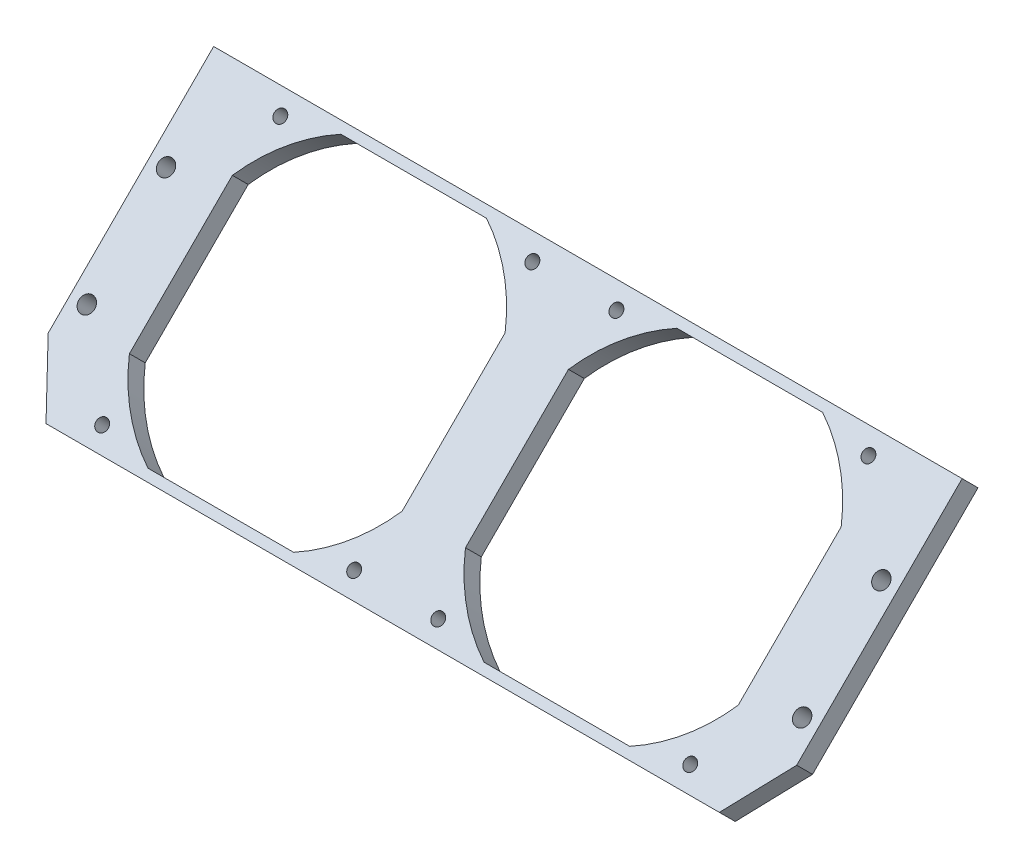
ISO-10303-21;
HEADER;
FILE_DESCRIPTION(('STEP AP214'),'2;1');
FILE_NAME('part.step','',(''),(''),'','','');
FILE_SCHEMA(('AUTOMOTIVE_DESIGN { 1 0 10303 214 1 1 1 1 }'));
ENDSEC;
DATA;
#1=APPLICATION_CONTEXT('core data for automotive mechanical design processes');
#2=APPLICATION_PROTOCOL_DEFINITION('international standard','automotive_design',2000,#1);
#3=PRODUCT_CONTEXT('',#1,'mechanical');
#4=PRODUCT('Part','Part','',(#3));
#5=PRODUCT_RELATED_PRODUCT_CATEGORY('part','',(#4));
#6=PRODUCT_DEFINITION_FORMATION('','',#4);
#7=PRODUCT_DEFINITION_CONTEXT('part definition',#1,'design');
#8=PRODUCT_DEFINITION('design','',#6,#7);
#9=PRODUCT_DEFINITION_SHAPE('','',#8);
#10=(LENGTH_UNIT() NAMED_UNIT(*) SI_UNIT(.MILLI.,.METRE.));
#11=(NAMED_UNIT(*) PLANE_ANGLE_UNIT() SI_UNIT($,.RADIAN.));
#12=(NAMED_UNIT(*) SI_UNIT($,.STERADIAN.) SOLID_ANGLE_UNIT());
#13=UNCERTAINTY_MEASURE_WITH_UNIT(LENGTH_MEASURE(1.E-05),#10,'distance_accuracy_value','');
#14=(GEOMETRIC_REPRESENTATION_CONTEXT(3) GLOBAL_UNCERTAINTY_ASSIGNED_CONTEXT((#13)) GLOBAL_UNIT_ASSIGNED_CONTEXT((#10,
#11,#12)) REPRESENTATION_CONTEXT('',''));
#15=CARTESIAN_POINT('',(0.,0.,0.));
#16=DIRECTION('',(0.,0.,1.));
#17=DIRECTION('',(1.,0.,0.));
#18=AXIS2_PLACEMENT_3D('',#15,#16,#17);
#19=CARTESIAN_POINT('',(-106.0704,62.6556485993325,1.31560752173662));
#20=DIRECTION('',(1.,0.,0.));
#21=DIRECTION('',(0.,0.,-1.));
#22=AXIS2_PLACEMENT_3D('',#19,#20,#21);
#23=PLANE('',#22);
#24=DIRECTION('',(0.,-0.707106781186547,0.707106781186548));
#25=VECTOR('',#24,1.);
#26=CARTESIAN_POINT('',(-106.0704,58.1655205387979,-3.17452053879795));
#27=LINE('',#26,#25);
#28=CARTESIAN_POINT('',(-106.0704,58.1655205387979,-3.17452053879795));
#29=VERTEX_POINT('',#28);
#30=CARTESIAN_POINT('',(-106.0704,11.2675153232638,43.7234846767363));
#31=VERTEX_POINT('',#30);
#32=EDGE_CURVE('E219',#29,#31,#27,.T.);
#33=ORIENTED_EDGE('',*,*,#32,.T.);
#34=DIRECTION('',(0.,0.707106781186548,0.707106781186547));
#35=VECTOR('',#34,1.);
#36=CARTESIAN_POINT('',(-106.0704,-17.8152449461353,14.6407244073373));
#37=LINE('',#36,#35);
#38=CARTESIAN_POINT('',(-106.0704,15.7576433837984,48.2136127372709));
#39=VERTEX_POINT('',#38);
#40=EDGE_CURVE('E64',#31,#39,#37,.T.);
#41=ORIENTED_EDGE('',*,*,#40,.T.);
#42=DIRECTION('',(0.,-0.707106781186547,0.707106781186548));
#43=VECTOR('',#42,1.);
#44=CARTESIAN_POINT('',(-106.0704,62.6556485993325,1.31560752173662));
#45=LINE('',#44,#43);
#46=CARTESIAN_POINT('',(-106.0704,62.6556485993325,1.31560752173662));
#47=VERTEX_POINT('',#46);
#48=EDGE_CURVE('E215',#47,#39,#45,.T.);
#49=ORIENTED_EDGE('',*,*,#48,.F.);
#50=DIRECTION('',(0.,-0.707106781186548,-0.707106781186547));
#51=VECTOR('',#50,1.);
#52=CARTESIAN_POINT('',(-106.0704,62.6556485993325,1.31560752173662));
#53=LINE('',#52,#51);
#54=EDGE_CURVE('E213',#47,#29,#53,.T.);
#55=ORIENTED_EDGE('',*,*,#54,.T.);
#56=EDGE_LOOP('',(#33,#41,#49,#55));
#57=FACE_BOUND('',#56,.T.);
#58=ADVANCED_FACE('F41',(#57),#23,.F.);
#59=CARTESIAN_POINT('',(-106.0704,4.49012806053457,59.4811280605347));
#60=DIRECTION('',(0.,0.707106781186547,-0.707106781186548));
#61=DIRECTION('',(0.,0.707106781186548,0.707106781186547));
#62=AXIS2_PLACEMENT_3D('',#59,#60,#61);
#63=PLANE('',#62);
#64=DIRECTION('',(1.,0.,0.));
#65=VECTOR('',#64,1.);
#66=CARTESIAN_POINT('',(-106.0704,0.,54.9910000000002));
#67=LINE('',#66,#65);
#68=CARTESIAN_POINT('',(-95.4224044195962,0.,54.9910000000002));
#69=VERTEX_POINT('',#68);
#70=CARTESIAN_POINT('',(95.4224044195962,0.,54.9910000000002));
#71=VERTEX_POINT('',#70);
#72=EDGE_CURVE('E222',#69,#71,#67,.T.);
#73=ORIENTED_EDGE('',*,*,#72,.T.);
#74=DIRECTION('',(0.,0.707106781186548,0.707106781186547));
#75=VECTOR('',#74,1.);
#76=CARTESIAN_POINT('',(95.4224044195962,-29.0827602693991,25.9082397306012));
#77=LINE('',#76,#75);
#78=CARTESIAN_POINT('',(95.4224044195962,4.49012806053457,59.4811280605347));
#79=VERTEX_POINT('',#78);
#80=EDGE_CURVE('E57',#71,#79,#77,.T.);
#81=ORIENTED_EDGE('',*,*,#80,.T.);
#82=DIRECTION('',(1.,0.,0.));
#83=VECTOR('',#82,1.);
#84=CARTESIAN_POINT('',(-106.0704,4.49012806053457,59.4811280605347));
#85=LINE('',#84,#83);
#86=CARTESIAN_POINT('',(-95.4224044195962,4.49012806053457,59.4811280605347));
#87=VERTEX_POINT('',#86);
#88=EDGE_CURVE('E204',#87,#79,#85,.T.);
#89=ORIENTED_EDGE('',*,*,#88,.F.);
#90=DIRECTION('',(0.,0.707106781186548,0.707106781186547));
#91=VECTOR('',#90,1.);
#92=CARTESIAN_POINT('',(-95.4224044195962,-29.0827602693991,25.9082397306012));
#93=LINE('',#92,#91);
#94=EDGE_CURVE('E205',#69,#87,#93,.T.);
#95=ORIENTED_EDGE('',*,*,#94,.F.);
#96=EDGE_LOOP('',(#73,#81,#89,#95));
#97=FACE_BOUND('',#96,.T.);
#98=ADVANCED_FACE('F449',(#97),#63,.F.);
#99=CARTESIAN_POINT('',(106.0704,62.6556485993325,1.31560752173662));
#100=DIRECTION('',(-1.,0.,0.));
#101=DIRECTION('',(0.,0.,1.));
#102=AXIS2_PLACEMENT_3D('',#99,#100,#101);
#103=PLANE('',#102);
#104=DIRECTION('',(0.,0.707106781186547,-0.707106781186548));
#105=VECTOR('',#104,1.);
#106=CARTESIAN_POINT('',(106.0704,62.6556485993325,1.31560752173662));
#107=LINE('',#106,#105);
#108=CARTESIAN_POINT('',(106.0704,15.7576433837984,48.2136127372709));
#109=VERTEX_POINT('',#108);
#110=CARTESIAN_POINT('',(106.0704,62.6556485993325,1.31560752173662));
#111=VERTEX_POINT('',#110);
#112=EDGE_CURVE('E200',#109,#111,#107,.T.);
#113=ORIENTED_EDGE('',*,*,#112,.F.);
#114=DIRECTION('',(0.,0.707106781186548,0.707106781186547));
#115=VECTOR('',#114,1.);
#116=CARTESIAN_POINT('',(106.0704,-17.8152449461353,14.6407244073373));
#117=LINE('',#116,#115);
#118=CARTESIAN_POINT('',(106.0704,11.2675153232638,43.7234846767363));
#119=VERTEX_POINT('',#118);
#120=EDGE_CURVE('E188',#119,#109,#117,.T.);
#121=ORIENTED_EDGE('',*,*,#120,.F.);
#122=DIRECTION('',(0.,0.707106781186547,-0.707106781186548));
#123=VECTOR('',#122,1.);
#124=CARTESIAN_POINT('',(106.0704,58.1655205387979,-3.17452053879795));
#125=LINE('',#124,#123);
#126=CARTESIAN_POINT('',(106.0704,58.1655205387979,-3.17452053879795));
#127=VERTEX_POINT('',#126);
#128=EDGE_CURVE('E226',#119,#127,#125,.T.);
#129=ORIENTED_EDGE('',*,*,#128,.T.);
#130=DIRECTION('',(0.,-0.707106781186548,-0.707106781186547));
#131=VECTOR('',#130,1.);
#132=CARTESIAN_POINT('',(106.0704,62.6556485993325,1.31560752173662));
#133=LINE('',#132,#131);
#134=EDGE_CURVE('E209',#111,#127,#133,.T.);
#135=ORIENTED_EDGE('',*,*,#134,.F.);
#136=EDGE_LOOP('',(#113,#121,#129,#135));
#137=FACE_BOUND('',#136,.T.);
#138=ADVANCED_FACE('F207',(#137),#103,.F.);
#139=CARTESIAN_POINT('',(-106.0704,62.6556485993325,1.31560752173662));
#140=DIRECTION('',(0.,-0.707106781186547,0.707106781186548));
#141=DIRECTION('',(0.,-0.707106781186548,-0.707106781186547));
#142=AXIS2_PLACEMENT_3D('',#139,#140,#141);
#143=PLANE('',#142);
#144=DIRECTION('',(-1.,0.,0.));
#145=VECTOR('',#144,1.);
#146=CARTESIAN_POINT('',(-106.0704,58.1655205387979,-3.17452053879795));
#147=LINE('',#146,#145);
#148=EDGE_CURVE('E228',#127,#29,#147,.T.);
#149=ORIENTED_EDGE('',*,*,#148,.T.);
#150=ORIENTED_EDGE('',*,*,#54,.F.);
#151=DIRECTION('',(-1.,0.,0.));
#152=VECTOR('',#151,1.);
#153=CARTESIAN_POINT('',(-106.0704,62.6556485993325,1.31560752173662));
#154=LINE('',#153,#152);
#155=EDGE_CURVE('E211',#111,#47,#154,.T.);
#156=ORIENTED_EDGE('',*,*,#155,.F.);
#157=ORIENTED_EDGE('',*,*,#134,.T.);
#158=EDGE_LOOP('',(#149,#150,#156,#157));
#159=FACE_BOUND('',#158,.T.);
#160=ADVANCED_FACE('F455',(#159),#143,.F.);
#161=CARTESIAN_POINT('',(0.,31.9856280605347,31.9856280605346));
#162=DIRECTION('',(0.,0.707106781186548,0.707106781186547));
#163=DIRECTION('',(0.,-0.707106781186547,0.707106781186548));
#164=AXIS2_PLACEMENT_3D('',#161,#162,#163);
#165=PLANE('',#164);
#166=CARTESIAN_POINT('',(101.3714,22.0056478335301,41.9656082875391));
#167=DIRECTION('',(0.,0.707106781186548,0.707106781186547));
#168=DIRECTION('',(0.,-0.707106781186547,0.707106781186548));
#169=AXIS2_PLACEMENT_3D('',#166,#167,#168);
#170=CIRCLE('',#169,2.2479);
#171=CARTESIAN_POINT('',(101.3714,20.4161425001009,43.5551136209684));
#172=VERTEX_POINT('',#171);
#173=EDGE_CURVE('E285',#172,#172,#170,.T.);
#174=ORIENTED_EDGE('',*,*,#173,.F.);
#175=EDGE_LOOP('',(#174));
#176=FACE_BOUND('',#175,.T.);
#177=CARTESIAN_POINT('',(101.3714,44.456288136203,19.5149679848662));
#178=DIRECTION('',(0.,0.707106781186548,0.707106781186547));
#179=DIRECTION('',(0.,-0.707106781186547,0.707106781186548));
#180=AXIS2_PLACEMENT_3D('',#177,#178,#179);
#181=CIRCLE('',#180,2.2479);
#182=CARTESIAN_POINT('',(101.3714,42.8667828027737,21.1044733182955));
#183=VERTEX_POINT('',#182);
#184=EDGE_CURVE('E274',#183,#183,#181,.T.);
#185=ORIENTED_EDGE('',*,*,#184,.F.);
#186=EDGE_LOOP('',(#185));
#187=FACE_BOUND('',#186,.T.);
#188=CARTESIAN_POINT('',(-101.3714,44.456288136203,19.5149679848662));
#189=DIRECTION('',(0.,0.707106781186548,0.707106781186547));
#190=DIRECTION('',(0.,-0.707106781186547,0.707106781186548));
#191=AXIS2_PLACEMENT_3D('',#188,#189,#190);
#192=CIRCLE('',#191,2.2479);
#193=CARTESIAN_POINT('',(-101.3714,42.8667828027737,21.1044733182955));
#194=VERTEX_POINT('',#193);
#195=EDGE_CURVE('E273',#194,#194,#192,.T.);
#196=ORIENTED_EDGE('',*,*,#195,.F.);
#197=EDGE_LOOP('',(#196));
#198=FACE_BOUND('',#197,.T.);
#199=CARTESIAN_POINT('',(-101.3714,22.0056478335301,41.9656082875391));
#200=DIRECTION('',(0.,0.707106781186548,0.707106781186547));
#201=DIRECTION('',(0.,-0.707106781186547,0.707106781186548));
#202=AXIS2_PLACEMENT_3D('',#199,#200,#201);
#203=CIRCLE('',#202,2.2479);
#204=CARTESIAN_POINT('',(-101.3714,20.4161425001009,43.5551136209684));
#205=VERTEX_POINT('',#204);
#206=EDGE_CURVE('E270',#205,#205,#203,.T.);
#207=ORIENTED_EDGE('',*,*,#206,.F.);
#208=EDGE_LOOP('',(#207));
#209=FACE_BOUND('',#208,.T.);
#210=DIRECTION('',(-0.555598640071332,-0.587924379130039,0.587924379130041));
#211=VECTOR('',#210,1.);
#212=CARTESIAN_POINT('',(106.0704,15.7576433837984,48.2136127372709));
#213=LINE('',#212,#211);
#214=EDGE_CURVE('E191',#109,#79,#213,.T.);
#215=ORIENTED_EDGE('',*,*,#214,.F.);
#216=ORIENTED_EDGE('',*,*,#112,.T.);
#217=ORIENTED_EDGE('',*,*,#155,.T.);
#218=ORIENTED_EDGE('',*,*,#48,.T.);
#219=DIRECTION('',(-0.555598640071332,0.587924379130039,-0.587924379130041));
#220=VECTOR('',#219,1.);
#221=CARTESIAN_POINT('',(-106.0704,15.7576433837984,48.2136127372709));
#222=LINE('',#221,#220);
#223=EDGE_CURVE('E269',#87,#39,#222,.T.);
#224=ORIENTED_EDGE('',*,*,#223,.F.);
#225=ORIENTED_EDGE('',*,*,#88,.T.);
#226=EDGE_LOOP('',(#215,#216,#217,#218,#224,#225));
#227=FACE_BOUND('',#226,.T.);
#228=CARTESIAN_POINT('',(11.9126,58.82536854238,5.14588757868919));
#229=DIRECTION('',(0.,0.707106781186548,0.707106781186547));
#230=DIRECTION('',(0.,-0.707106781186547,0.707106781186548));
#231=AXIS2_PLACEMENT_3D('',#228,#229,#230);
#232=CIRCLE('',#231,1.72719999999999);
#233=CARTESIAN_POINT('',(11.9126,57.6040537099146,6.36720241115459));
#234=VERTEX_POINT('',#233);
#235=EDGE_CURVE('E265',#234,#234,#232,.T.);
#236=ORIENTED_EDGE('',*,*,#235,.F.);
#237=EDGE_LOOP('',(#236));
#238=FACE_BOUND('',#237,.T.);
#239=CARTESIAN_POINT('',(83.3374,58.82536854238,5.14588757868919));
#240=DIRECTION('',(0.,0.707106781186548,0.707106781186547));
#241=DIRECTION('',(0.,-0.707106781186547,0.707106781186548));
#242=AXIS2_PLACEMENT_3D('',#239,#240,#241);
#243=CIRCLE('',#242,1.7272);
#244=CARTESIAN_POINT('',(83.3374,57.6040537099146,6.36720241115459));
#245=VERTEX_POINT('',#244);
#246=EDGE_CURVE('E261',#245,#245,#243,.T.);
#247=ORIENTED_EDGE('',*,*,#246,.F.);
#248=EDGE_LOOP('',(#247));
#249=FACE_BOUND('',#248,.T.);
#250=CARTESIAN_POINT('',(83.3374,8.32040811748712,55.6508480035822));
#251=DIRECTION('',(0.,0.707106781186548,0.707106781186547));
#252=DIRECTION('',(0.,-0.707106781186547,0.707106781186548));
#253=AXIS2_PLACEMENT_3D('',#250,#251,#252);
#254=CIRCLE('',#253,1.7272);
#255=CARTESIAN_POINT('',(83.3374,7.09909328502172,56.8721628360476));
#256=VERTEX_POINT('',#255);
#257=EDGE_CURVE('E257',#256,#256,#254,.T.);
#258=ORIENTED_EDGE('',*,*,#257,.F.);
#259=EDGE_LOOP('',(#258));
#260=FACE_BOUND('',#259,.T.);
#261=CARTESIAN_POINT('',(11.9126,8.32040811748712,55.6508480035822));
#262=DIRECTION('',(0.,0.707106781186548,0.707106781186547));
#263=DIRECTION('',(0.,-0.707106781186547,0.707106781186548));
#264=AXIS2_PLACEMENT_3D('',#261,#262,#263);
#265=CIRCLE('',#264,1.72719999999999);
#266=CARTESIAN_POINT('',(11.9126,7.09909328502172,56.8721628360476));
#267=VERTEX_POINT('',#266);
#268=EDGE_CURVE('E253',#267,#267,#265,.T.);
#269=ORIENTED_EDGE('',*,*,#268,.F.);
#270=EDGE_LOOP('',(#269));
#271=FACE_BOUND('',#270,.T.);
#272=CARTESIAN_POINT('',(-11.9126,8.32040811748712,55.6508480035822));
#273=DIRECTION('',(0.,0.707106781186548,0.707106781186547));
#274=DIRECTION('',(0.,-0.707106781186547,0.707106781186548));
#275=AXIS2_PLACEMENT_3D('',#272,#273,#274);
#276=CIRCLE('',#275,1.72719999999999);
#277=CARTESIAN_POINT('',(-11.9126,7.09909328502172,56.8721628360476));
#278=VERTEX_POINT('',#277);
#279=EDGE_CURVE('E249',#278,#278,#276,.T.);
#280=ORIENTED_EDGE('',*,*,#279,.F.);
#281=EDGE_LOOP('',(#280));
#282=FACE_BOUND('',#281,.T.);
#283=CARTESIAN_POINT('',(-83.3374,8.32040811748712,55.6508480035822));
#284=DIRECTION('',(0.,0.707106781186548,0.707106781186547));
#285=DIRECTION('',(0.,-0.707106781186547,0.707106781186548));
#286=AXIS2_PLACEMENT_3D('',#283,#284,#285);
#287=CIRCLE('',#286,1.7272);
#288=CARTESIAN_POINT('',(-83.3374,7.09909328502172,56.8721628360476));
#289=VERTEX_POINT('',#288);
#290=EDGE_CURVE('E245',#289,#289,#287,.T.);
#291=ORIENTED_EDGE('',*,*,#290,.F.);
#292=EDGE_LOOP('',(#291));
#293=FACE_BOUND('',#292,.T.);
#294=CARTESIAN_POINT('',(-83.3374,58.82536854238,5.14588757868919));
#295=DIRECTION('',(0.,0.707106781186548,0.707106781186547));
#296=DIRECTION('',(0.,-0.707106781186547,0.707106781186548));
#297=AXIS2_PLACEMENT_3D('',#294,#295,#296);
#298=CIRCLE('',#297,1.7272);
#299=CARTESIAN_POINT('',(-83.3374,57.6040537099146,6.36720241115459));
#300=VERTEX_POINT('',#299);
#301=EDGE_CURVE('E241',#300,#300,#298,.T.);
#302=ORIENTED_EDGE('',*,*,#301,.F.);
#303=EDGE_LOOP('',(#302));
#304=FACE_BOUND('',#303,.T.);
#305=CARTESIAN_POINT('',(-11.9126,58.82536854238,5.14588757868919));
#306=DIRECTION('',(0.,0.707106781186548,0.707106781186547));
#307=DIRECTION('',(0.,-0.707106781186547,0.707106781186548));
#308=AXIS2_PLACEMENT_3D('',#305,#306,#307);
#309=CIRCLE('',#308,1.72719999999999);
#310=CARTESIAN_POINT('',(-11.9126,57.6040537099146,6.36720241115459));
#311=VERTEX_POINT('',#310);
#312=EDGE_CURVE('E237',#311,#311,#309,.T.);
#313=ORIENTED_EDGE('',*,*,#312,.F.);
#314=EDGE_LOOP('',(#313));
#315=FACE_BOUND('',#314,.T.);
#316=CARTESIAN_POINT('',(47.625,33.5728883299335,30.3983677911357));
#317=DIRECTION('',(0.,0.707106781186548,0.707106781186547));
#318=DIRECTION('',(0.,-0.707106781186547,0.707106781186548));
#319=AXIS2_PLACEMENT_3D('',#316,#317,#318);
#320=CIRCLE('',#319,43.815);
#321=CARTESIAN_POINT('',(68.2625,6.24297963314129,57.728276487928));
#322=VERTEX_POINT('',#321);
#323=CARTESIAN_POINT('',(86.275327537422,18.9799721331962,44.9912839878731));
#324=VERTEX_POINT('',#323);
#325=EDGE_CURVE('E338',#322,#324,#320,.T.);
#326=ORIENTED_EDGE('',*,*,#325,.F.);
#327=DIRECTION('',(1.,0.,0.));
#328=VECTOR('',#327,1.);
#329=CARTESIAN_POINT('',(26.9875,6.24297963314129,57.728276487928));
#330=LINE('',#329,#328);
#331=CARTESIAN_POINT('',(26.9875,6.24297963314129,57.728276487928));
#332=VERTEX_POINT('',#331);
#333=EDGE_CURVE('E316',#332,#322,#330,.T.);
#334=ORIENTED_EDGE('',*,*,#333,.F.);
#335=CARTESIAN_POINT('',(47.625,33.5728883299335,30.3983677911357));
#336=DIRECTION('',(0.,0.707106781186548,0.707106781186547));
#337=DIRECTION('',(0.,-0.707106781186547,0.707106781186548));
#338=AXIS2_PLACEMENT_3D('',#335,#336,#337);
#339=CIRCLE('',#338,43.815);
#340=CARTESIAN_POINT('',(8.974672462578,18.9799721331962,44.9912839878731));
#341=VERTEX_POINT('',#340);
#342=EDGE_CURVE('E356',#341,#332,#339,.T.);
#343=ORIENTED_EDGE('',*,*,#342,.F.);
#344=DIRECTION('',(0.,-0.707106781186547,0.707106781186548));
#345=VECTOR('',#344,1.);
#346=CARTESIAN_POINT('',(8.97467246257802,48.1658045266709,15.8054515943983));
#347=LINE('',#346,#345);
#348=CARTESIAN_POINT('',(8.97467246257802,48.1658045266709,15.8054515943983));
#349=VERTEX_POINT('',#348);
#350=EDGE_CURVE('E353',#349,#341,#347,.T.);
#351=ORIENTED_EDGE('',*,*,#350,.F.);
#352=CARTESIAN_POINT('',(47.625,33.5728883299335,30.3983677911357));
#353=DIRECTION('',(0.,0.707106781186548,0.707106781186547));
#354=DIRECTION('',(0.,-0.707106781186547,0.707106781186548));
#355=AXIS2_PLACEMENT_3D('',#352,#353,#354);
#356=CIRCLE('',#355,43.815);
#357=CARTESIAN_POINT('',(26.9875,60.9027970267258,3.06845909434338));
#358=VERTEX_POINT('',#357);
#359=EDGE_CURVE('E350',#358,#349,#356,.T.);
#360=ORIENTED_EDGE('',*,*,#359,.F.);
#361=DIRECTION('',(-1.,0.,0.));
#362=VECTOR('',#361,1.);
#363=CARTESIAN_POINT('',(26.9875,60.9027970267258,3.06845909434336));
#364=LINE('',#363,#362);
#365=CARTESIAN_POINT('',(68.2625,60.9027970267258,3.06845909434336));
#366=VERTEX_POINT('',#365);
#367=EDGE_CURVE('E347',#366,#358,#364,.T.);
#368=ORIENTED_EDGE('',*,*,#367,.F.);
#369=CARTESIAN_POINT('',(47.625,33.5728883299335,30.3983677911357));
#370=DIRECTION('',(0.,0.707106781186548,0.707106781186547));
#371=DIRECTION('',(0.,-0.707106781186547,0.707106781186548));
#372=AXIS2_PLACEMENT_3D('',#369,#370,#371);
#373=CIRCLE('',#372,43.815);
#374=CARTESIAN_POINT('',(86.275327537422,48.1658045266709,15.8054515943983));
#375=VERTEX_POINT('',#374);
#376=EDGE_CURVE('E344',#375,#366,#373,.T.);
#377=ORIENTED_EDGE('',*,*,#376,.F.);
#378=DIRECTION('',(0.,0.707106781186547,-0.707106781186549));
#379=VECTOR('',#378,1.);
#380=CARTESIAN_POINT('',(86.275327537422,48.1658045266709,15.8054515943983));
#381=LINE('',#380,#379);
#382=EDGE_CURVE('E340',#324,#375,#381,.T.);
#383=ORIENTED_EDGE('',*,*,#382,.F.);
#384=EDGE_LOOP('',(#326,#334,#343,#351,#360,#368,#377,#383));
#385=FACE_BOUND('',#384,.T.);
#386=CARTESIAN_POINT('',(-47.625,33.5728883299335,30.3983677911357));
#387=DIRECTION('',(0.,0.707106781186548,0.707106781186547));
#388=DIRECTION('',(0.,0.707106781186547,-0.707106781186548));
#389=AXIS2_PLACEMENT_3D('',#386,#387,#388);
#390=CIRCLE('',#389,43.815);
#391=CARTESIAN_POINT('',(-68.2625,60.9027970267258,3.06845909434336));
#392=VERTEX_POINT('',#391);
#393=CARTESIAN_POINT('',(-86.275327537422,48.1658045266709,15.8054515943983));
#394=VERTEX_POINT('',#393);
#395=EDGE_CURVE('E236',#392,#394,#390,.T.);
#396=ORIENTED_EDGE('',*,*,#395,.F.);
#397=DIRECTION('',(-1.,0.,0.));
#398=VECTOR('',#397,1.);
#399=CARTESIAN_POINT('',(-26.9875,60.9027970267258,3.06845909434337));
#400=LINE('',#399,#398);
#401=CARTESIAN_POINT('',(-26.9875,60.9027970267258,3.06845909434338));
#402=VERTEX_POINT('',#401);
#403=EDGE_CURVE('E380',#402,#392,#400,.T.);
#404=ORIENTED_EDGE('',*,*,#403,.F.);
#405=CARTESIAN_POINT('',(-47.625,33.5728883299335,30.3983677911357));
#406=DIRECTION('',(0.,0.707106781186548,0.707106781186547));
#407=DIRECTION('',(0.,0.707106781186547,-0.707106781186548));
#408=AXIS2_PLACEMENT_3D('',#405,#406,#407);
#409=CIRCLE('',#408,43.815);
#410=CARTESIAN_POINT('',(-8.97467246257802,48.1658045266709,15.8054515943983));
#411=VERTEX_POINT('',#410);
#412=EDGE_CURVE('E418',#411,#402,#409,.T.);
#413=ORIENTED_EDGE('',*,*,#412,.F.);
#414=DIRECTION('',(0.,0.707106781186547,-0.707106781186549));
#415=VECTOR('',#414,1.);
#416=CARTESIAN_POINT('',(-8.97467246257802,48.1658045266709,15.8054515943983));
#417=LINE('',#416,#415);
#418=CARTESIAN_POINT('',(-8.974672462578,18.9799721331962,44.9912839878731));
#419=VERTEX_POINT('',#418);
#420=EDGE_CURVE('E415',#419,#411,#417,.T.);
#421=ORIENTED_EDGE('',*,*,#420,.F.);
#422=CARTESIAN_POINT('',(-47.625,33.5728883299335,30.3983677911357));
#423=DIRECTION('',(0.,0.707106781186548,0.707106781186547));
#424=DIRECTION('',(0.,0.707106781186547,-0.707106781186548));
#425=AXIS2_PLACEMENT_3D('',#422,#423,#424);
#426=CIRCLE('',#425,43.815);
#427=CARTESIAN_POINT('',(-26.9875,6.24297963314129,57.728276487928));
#428=VERTEX_POINT('',#427);
#429=EDGE_CURVE('E412',#428,#419,#426,.T.);
#430=ORIENTED_EDGE('',*,*,#429,.F.);
#431=DIRECTION('',(1.,0.,0.));
#432=VECTOR('',#431,1.);
#433=CARTESIAN_POINT('',(-26.9875,6.24297963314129,57.728276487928));
#434=LINE('',#433,#432);
#435=CARTESIAN_POINT('',(-68.2625,6.2429796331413,57.728276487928));
#436=VERTEX_POINT('',#435);
#437=EDGE_CURVE('E409',#436,#428,#434,.T.);
#438=ORIENTED_EDGE('',*,*,#437,.F.);
#439=CARTESIAN_POINT('',(-47.625,33.5728883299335,30.3983677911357));
#440=DIRECTION('',(0.,0.707106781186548,0.707106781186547));
#441=DIRECTION('',(0.,0.707106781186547,-0.707106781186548));
#442=AXIS2_PLACEMENT_3D('',#439,#440,#441);
#443=CIRCLE('',#442,43.815);
#444=CARTESIAN_POINT('',(-86.275327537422,18.9799721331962,44.9912839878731));
#445=VERTEX_POINT('',#444);
#446=EDGE_CURVE('E406',#445,#436,#443,.T.);
#447=ORIENTED_EDGE('',*,*,#446,.F.);
#448=DIRECTION('',(0.,-0.707106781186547,0.707106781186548));
#449=VECTOR('',#448,1.);
#450=CARTESIAN_POINT('',(-86.275327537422,48.1658045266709,15.8054515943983));
#451=LINE('',#450,#449);
#452=EDGE_CURVE('E403',#394,#445,#451,.T.);
#453=ORIENTED_EDGE('',*,*,#452,.F.);
#454=EDGE_LOOP('',(#396,#404,#413,#421,#430,#438,#447,#453));
#455=FACE_BOUND('',#454,.T.);
#456=ADVANCED_FACE('F198',(#176,#187,#198,#209,#227,#238,#249,#260,#271,#282,#293,#304,#315,
#385,#455),#165,.T.);
#457=CARTESIAN_POINT('',(0.,27.4955000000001,27.4955));
#458=DIRECTION('',(0.,0.707106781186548,0.707106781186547));
#459=DIRECTION('',(0.,-0.707106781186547,0.707106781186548));
#460=AXIS2_PLACEMENT_3D('',#457,#458,#459);
#461=PLANE('',#460);
#462=CARTESIAN_POINT('',(101.3714,17.5155197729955,37.4754802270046));
#463=DIRECTION('',(0.,0.707106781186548,0.707106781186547));
#464=DIRECTION('',(0.,-0.707106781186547,0.707106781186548));
#465=AXIS2_PLACEMENT_3D('',#462,#463,#464);
#466=CIRCLE('',#465,2.2479);
#467=CARTESIAN_POINT('',(101.3714,15.9260144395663,39.0649855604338));
#468=VERTEX_POINT('',#467);
#469=EDGE_CURVE('E44',#468,#468,#466,.T.);
#470=ORIENTED_EDGE('',*,*,#469,.T.);
#471=EDGE_LOOP('',(#470));
#472=FACE_BOUND('',#471,.T.);
#473=CARTESIAN_POINT('',(101.3714,39.9661600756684,15.0248399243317));
#474=DIRECTION('',(0.,0.707106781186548,0.707106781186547));
#475=DIRECTION('',(0.,-0.707106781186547,0.707106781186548));
#476=AXIS2_PLACEMENT_3D('',#473,#474,#475);
#477=CIRCLE('',#476,2.2479);
#478=CARTESIAN_POINT('',(101.3714,38.3766547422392,16.6143452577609));
#479=VERTEX_POINT('',#478);
#480=EDGE_CURVE('E271',#479,#479,#477,.T.);
#481=ORIENTED_EDGE('',*,*,#480,.T.);
#482=EDGE_LOOP('',(#481));
#483=FACE_BOUND('',#482,.T.);
#484=CARTESIAN_POINT('',(-101.3714,39.9661600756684,15.0248399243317));
#485=DIRECTION('',(0.,0.707106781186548,0.707106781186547));
#486=DIRECTION('',(0.,-0.707106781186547,0.707106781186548));
#487=AXIS2_PLACEMENT_3D('',#484,#485,#486);
#488=CIRCLE('',#487,2.2479);
#489=CARTESIAN_POINT('',(-101.3714,38.3766547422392,16.6143452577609));
#490=VERTEX_POINT('',#489);
#491=EDGE_CURVE('E278',#490,#490,#488,.T.);
#492=ORIENTED_EDGE('',*,*,#491,.T.);
#493=EDGE_LOOP('',(#492));
#494=FACE_BOUND('',#493,.T.);
#495=CARTESIAN_POINT('',(-101.3714,17.5155197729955,37.4754802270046));
#496=DIRECTION('',(0.,0.707106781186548,0.707106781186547));
#497=DIRECTION('',(0.,-0.707106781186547,0.707106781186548));
#498=AXIS2_PLACEMENT_3D('',#495,#496,#497);
#499=CIRCLE('',#498,2.2479);
#500=CARTESIAN_POINT('',(-101.3714,15.9260144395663,39.0649855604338));
#501=VERTEX_POINT('',#500);
#502=EDGE_CURVE('E267',#501,#501,#499,.T.);
#503=ORIENTED_EDGE('',*,*,#502,.T.);
#504=EDGE_LOOP('',(#503));
#505=FACE_BOUND('',#504,.T.);
#506=CARTESIAN_POINT('',(11.9126,54.3352404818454,0.65575951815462));
#507=DIRECTION('',(0.,0.707106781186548,0.707106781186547));
#508=DIRECTION('',(0.,-0.707106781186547,0.707106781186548));
#509=AXIS2_PLACEMENT_3D('',#506,#507,#508);
#510=CIRCLE('',#509,1.72719999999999);
#511=CARTESIAN_POINT('',(11.9126,53.11392564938,1.87707435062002));
#512=VERTEX_POINT('',#511);
#513=EDGE_CURVE('E262',#512,#512,#510,.T.);
#514=ORIENTED_EDGE('',*,*,#513,.T.);
#515=EDGE_LOOP('',(#514));
#516=FACE_BOUND('',#515,.T.);
#517=CARTESIAN_POINT('',(83.3374,54.3352404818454,0.65575951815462));
#518=DIRECTION('',(0.,0.707106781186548,0.707106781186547));
#519=DIRECTION('',(0.,-0.707106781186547,0.707106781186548));
#520=AXIS2_PLACEMENT_3D('',#517,#518,#519);
#521=CIRCLE('',#520,1.72719999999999);
#522=CARTESIAN_POINT('',(83.3374,53.11392564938,1.87707435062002));
#523=VERTEX_POINT('',#522);
#524=EDGE_CURVE('E258',#523,#523,#521,.T.);
#525=ORIENTED_EDGE('',*,*,#524,.T.);
#526=EDGE_LOOP('',(#525));
#527=FACE_BOUND('',#526,.T.);
#528=CARTESIAN_POINT('',(83.3374,3.83028005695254,51.1607199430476));
#529=DIRECTION('',(0.,0.707106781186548,0.707106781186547));
#530=DIRECTION('',(0.,-0.707106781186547,0.707106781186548));
#531=AXIS2_PLACEMENT_3D('',#528,#529,#530);
#532=CIRCLE('',#531,1.72719999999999);
#533=CARTESIAN_POINT('',(83.3374,2.60896522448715,52.382034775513));
#534=VERTEX_POINT('',#533);
#535=EDGE_CURVE('E254',#534,#534,#532,.T.);
#536=ORIENTED_EDGE('',*,*,#535,.T.);
#537=EDGE_LOOP('',(#536));
#538=FACE_BOUND('',#537,.T.);
#539=CARTESIAN_POINT('',(11.9126,3.83028005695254,51.1607199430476));
#540=DIRECTION('',(0.,0.707106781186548,0.707106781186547));
#541=DIRECTION('',(0.,-0.707106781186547,0.707106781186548));
#542=AXIS2_PLACEMENT_3D('',#539,#540,#541);
#543=CIRCLE('',#542,1.72719999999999);
#544=CARTESIAN_POINT('',(11.9126,2.60896522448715,52.382034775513));
#545=VERTEX_POINT('',#544);
#546=EDGE_CURVE('E250',#545,#545,#543,.T.);
#547=ORIENTED_EDGE('',*,*,#546,.T.);
#548=EDGE_LOOP('',(#547));
#549=FACE_BOUND('',#548,.T.);
#550=CARTESIAN_POINT('',(-11.9126,3.83028005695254,51.1607199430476));
#551=DIRECTION('',(0.,0.707106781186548,0.707106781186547));
#552=DIRECTION('',(0.,-0.707106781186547,0.707106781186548));
#553=AXIS2_PLACEMENT_3D('',#550,#551,#552);
#554=CIRCLE('',#553,1.72719999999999);
#555=CARTESIAN_POINT('',(-11.9126,2.60896522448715,52.382034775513));
#556=VERTEX_POINT('',#555);
#557=EDGE_CURVE('E246',#556,#556,#554,.T.);
#558=ORIENTED_EDGE('',*,*,#557,.T.);
#559=EDGE_LOOP('',(#558));
#560=FACE_BOUND('',#559,.T.);
#561=CARTESIAN_POINT('',(-83.3374,3.83028005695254,51.1607199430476));
#562=DIRECTION('',(0.,0.707106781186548,0.707106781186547));
#563=DIRECTION('',(0.,-0.707106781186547,0.707106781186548));
#564=AXIS2_PLACEMENT_3D('',#561,#562,#563);
#565=CIRCLE('',#564,1.72719999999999);
#566=CARTESIAN_POINT('',(-83.3374,2.60896522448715,52.382034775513));
#567=VERTEX_POINT('',#566);
#568=EDGE_CURVE('E242',#567,#567,#565,.T.);
#569=ORIENTED_EDGE('',*,*,#568,.T.);
#570=EDGE_LOOP('',(#569));
#571=FACE_BOUND('',#570,.T.);
#572=CARTESIAN_POINT('',(-83.3374,54.3352404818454,0.65575951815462));
#573=DIRECTION('',(0.,0.707106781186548,0.707106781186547));
#574=DIRECTION('',(0.,-0.707106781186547,0.707106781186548));
#575=AXIS2_PLACEMENT_3D('',#572,#573,#574);
#576=CIRCLE('',#575,1.72719999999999);
#577=CARTESIAN_POINT('',(-83.3374,53.11392564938,1.87707435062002));
#578=VERTEX_POINT('',#577);
#579=EDGE_CURVE('E238',#578,#578,#576,.T.);
#580=ORIENTED_EDGE('',*,*,#579,.T.);
#581=EDGE_LOOP('',(#580));
#582=FACE_BOUND('',#581,.T.);
#583=CARTESIAN_POINT('',(-11.9126,54.3352404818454,0.65575951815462));
#584=DIRECTION('',(0.,0.707106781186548,0.707106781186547));
#585=DIRECTION('',(0.,-0.707106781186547,0.707106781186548));
#586=AXIS2_PLACEMENT_3D('',#583,#584,#585);
#587=CIRCLE('',#586,1.72719999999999);
#588=CARTESIAN_POINT('',(-11.9126,53.11392564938,1.87707435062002));
#589=VERTEX_POINT('',#588);
#590=EDGE_CURVE('E233',#589,#589,#587,.T.);
#591=ORIENTED_EDGE('',*,*,#590,.T.);
#592=EDGE_LOOP('',(#591));
#593=FACE_BOUND('',#592,.T.);
#594=DIRECTION('',(1.,0.,0.));
#595=VECTOR('',#594,1.);
#596=CARTESIAN_POINT('',(26.9875,1.75285157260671,53.2381484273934));
#597=LINE('',#596,#595);
#598=CARTESIAN_POINT('',(26.9875,1.75285157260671,53.2381484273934));
#599=VERTEX_POINT('',#598);
#600=CARTESIAN_POINT('',(68.2625,1.75285157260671,53.2381484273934));
#601=VERTEX_POINT('',#600);
#602=EDGE_CURVE('E334',#599,#601,#597,.T.);
#603=ORIENTED_EDGE('',*,*,#602,.T.);
#604=CARTESIAN_POINT('',(47.625,29.082760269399,25.9082397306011));
#605=DIRECTION('',(0.,0.707106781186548,0.707106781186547));
#606=DIRECTION('',(0.,-0.707106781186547,0.707106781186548));
#607=AXIS2_PLACEMENT_3D('',#604,#605,#606);
#608=CIRCLE('',#607,43.815);
#609=CARTESIAN_POINT('',(86.275327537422,14.4898440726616,40.5011559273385));
#610=VERTEX_POINT('',#609);
#611=EDGE_CURVE('E312',#601,#610,#608,.T.);
#612=ORIENTED_EDGE('',*,*,#611,.T.);
#613=DIRECTION('',(0.,0.707106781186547,-0.707106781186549));
#614=VECTOR('',#613,1.);
#615=CARTESIAN_POINT('',(86.275327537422,43.6756764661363,11.3153235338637));
#616=LINE('',#615,#614);
#617=CARTESIAN_POINT('',(86.275327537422,43.6756764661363,11.3153235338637));
#618=VERTEX_POINT('',#617);
#619=EDGE_CURVE('E315',#610,#618,#616,.T.);
#620=ORIENTED_EDGE('',*,*,#619,.T.);
#621=CARTESIAN_POINT('',(47.625,29.082760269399,25.9082397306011));
#622=DIRECTION('',(0.,0.707106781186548,0.707106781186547));
#623=DIRECTION('',(0.,-0.707106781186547,0.707106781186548));
#624=AXIS2_PLACEMENT_3D('',#621,#622,#623);
#625=CIRCLE('',#624,43.815);
#626=CARTESIAN_POINT('',(68.2625,56.4126689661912,-1.42166896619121));
#627=VERTEX_POINT('',#626);
#628=EDGE_CURVE('E319',#618,#627,#625,.T.);
#629=ORIENTED_EDGE('',*,*,#628,.T.);
#630=DIRECTION('',(-1.,0.,0.));
#631=VECTOR('',#630,1.);
#632=CARTESIAN_POINT('',(26.9875,56.4126689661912,-1.42166896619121));
#633=LINE('',#632,#631);
#634=CARTESIAN_POINT('',(26.9875,56.4126689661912,-1.42166896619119));
#635=VERTEX_POINT('',#634);
#636=EDGE_CURVE('E322',#627,#635,#633,.T.);
#637=ORIENTED_EDGE('',*,*,#636,.T.);
#638=CARTESIAN_POINT('',(47.625,29.082760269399,25.9082397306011));
#639=DIRECTION('',(0.,0.707106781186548,0.707106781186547));
#640=DIRECTION('',(0.,-0.707106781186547,0.707106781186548));
#641=AXIS2_PLACEMENT_3D('',#638,#639,#640);
#642=CIRCLE('',#641,43.815);
#643=CARTESIAN_POINT('',(8.97467246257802,43.6756764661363,11.3153235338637));
#644=VERTEX_POINT('',#643);
#645=EDGE_CURVE('E325',#635,#644,#642,.T.);
#646=ORIENTED_EDGE('',*,*,#645,.T.);
#647=DIRECTION('',(0.,-0.707106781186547,0.707106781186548));
#648=VECTOR('',#647,1.);
#649=CARTESIAN_POINT('',(8.97467246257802,43.6756764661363,11.3153235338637));
#650=LINE('',#649,#648);
#651=CARTESIAN_POINT('',(8.974672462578,14.4898440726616,40.5011559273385));
#652=VERTEX_POINT('',#651);
#653=EDGE_CURVE('E328',#644,#652,#650,.T.);
#654=ORIENTED_EDGE('',*,*,#653,.T.);
#655=CARTESIAN_POINT('',(47.625,29.082760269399,25.9082397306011));
#656=DIRECTION('',(0.,0.707106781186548,0.707106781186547));
#657=DIRECTION('',(0.,-0.707106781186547,0.707106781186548));
#658=AXIS2_PLACEMENT_3D('',#655,#656,#657);
#659=CIRCLE('',#658,43.815);
#660=EDGE_CURVE('E331',#652,#599,#659,.T.);
#661=ORIENTED_EDGE('',*,*,#660,.T.);
#662=EDGE_LOOP('',(#603,#612,#620,#629,#637,#646,#654,#661));
#663=FACE_BOUND('',#662,.T.);
#664=DIRECTION('',(-1.,0.,0.));
#665=VECTOR('',#664,1.);
#666=CARTESIAN_POINT('',(-26.9875,56.4126689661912,-1.42166896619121));
#667=LINE('',#666,#665);
#668=CARTESIAN_POINT('',(-26.9875,56.4126689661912,-1.42166896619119));
#669=VERTEX_POINT('',#668);
#670=CARTESIAN_POINT('',(-68.2625,56.4126689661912,-1.42166896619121));
#671=VERTEX_POINT('',#670);
#672=EDGE_CURVE('E398',#669,#671,#667,.T.);
#673=ORIENTED_EDGE('',*,*,#672,.T.);
#674=CARTESIAN_POINT('',(-47.625,29.0827602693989,25.9082397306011));
#675=DIRECTION('',(0.,0.707106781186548,0.707106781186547));
#676=DIRECTION('',(0.,0.707106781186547,-0.707106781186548));
#677=AXIS2_PLACEMENT_3D('',#674,#675,#676);
#678=CIRCLE('',#677,43.815);
#679=CARTESIAN_POINT('',(-86.275327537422,43.6756764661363,11.3153235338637));
#680=VERTEX_POINT('',#679);
#681=EDGE_CURVE('E376',#671,#680,#678,.T.);
#682=ORIENTED_EDGE('',*,*,#681,.T.);
#683=DIRECTION('',(0.,-0.707106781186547,0.707106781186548));
#684=VECTOR('',#683,1.);
#685=CARTESIAN_POINT('',(-86.275327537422,43.6756764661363,11.3153235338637));
#686=LINE('',#685,#684);
#687=CARTESIAN_POINT('',(-86.275327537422,14.4898440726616,40.5011559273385));
#688=VERTEX_POINT('',#687);
#689=EDGE_CURVE('E379',#680,#688,#686,.T.);
#690=ORIENTED_EDGE('',*,*,#689,.T.);
#691=CARTESIAN_POINT('',(-47.625,29.0827602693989,25.9082397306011));
#692=DIRECTION('',(0.,0.707106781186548,0.707106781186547));
#693=DIRECTION('',(0.,0.707106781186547,-0.707106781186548));
#694=AXIS2_PLACEMENT_3D('',#691,#692,#693);
#695=CIRCLE('',#694,43.815);
#696=CARTESIAN_POINT('',(-68.2625,1.75285157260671,53.2381484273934));
#697=VERTEX_POINT('',#696);
#698=EDGE_CURVE('E383',#688,#697,#695,.T.);
#699=ORIENTED_EDGE('',*,*,#698,.T.);
#700=DIRECTION('',(1.,0.,0.));
#701=VECTOR('',#700,1.);
#702=CARTESIAN_POINT('',(-26.9875,1.75285157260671,53.2381484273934));
#703=LINE('',#702,#701);
#704=CARTESIAN_POINT('',(-26.9875,1.75285157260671,53.2381484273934));
#705=VERTEX_POINT('',#704);
#706=EDGE_CURVE('E386',#697,#705,#703,.T.);
#707=ORIENTED_EDGE('',*,*,#706,.T.);
#708=CARTESIAN_POINT('',(-47.625,29.0827602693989,25.9082397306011));
#709=DIRECTION('',(0.,0.707106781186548,0.707106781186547));
#710=DIRECTION('',(0.,0.707106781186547,-0.707106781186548));
#711=AXIS2_PLACEMENT_3D('',#708,#709,#710);
#712=CIRCLE('',#711,43.815);
#713=CARTESIAN_POINT('',(-8.974672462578,14.4898440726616,40.5011559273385));
#714=VERTEX_POINT('',#713);
#715=EDGE_CURVE('E389',#705,#714,#712,.T.);
#716=ORIENTED_EDGE('',*,*,#715,.T.);
#717=DIRECTION('',(0.,0.707106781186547,-0.707106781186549));
#718=VECTOR('',#717,1.);
#719=CARTESIAN_POINT('',(-8.97467246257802,43.6756764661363,11.3153235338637));
#720=LINE('',#719,#718);
#721=CARTESIAN_POINT('',(-8.97467246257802,43.6756764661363,11.3153235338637));
#722=VERTEX_POINT('',#721);
#723=EDGE_CURVE('E392',#714,#722,#720,.T.);
#724=ORIENTED_EDGE('',*,*,#723,.T.);
#725=CARTESIAN_POINT('',(-47.625,29.0827602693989,25.9082397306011));
#726=DIRECTION('',(0.,0.707106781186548,0.707106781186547));
#727=DIRECTION('',(0.,0.707106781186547,-0.707106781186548));
#728=AXIS2_PLACEMENT_3D('',#725,#726,#727);
#729=CIRCLE('',#728,43.815);
#730=EDGE_CURVE('E395',#722,#669,#729,.T.);
#731=ORIENTED_EDGE('',*,*,#730,.T.);
#732=EDGE_LOOP('',(#673,#682,#690,#699,#707,#716,#724,#731));
#733=FACE_BOUND('',#732,.T.);
#734=ORIENTED_EDGE('',*,*,#128,.F.);
#735=DIRECTION('',(-0.555598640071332,-0.587924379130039,0.587924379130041));
#736=VECTOR('',#735,1.);
#737=CARTESIAN_POINT('',(83.9292861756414,-12.161808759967,67.1528087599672));
#738=LINE('',#737,#736);
#739=EDGE_CURVE('E11',#119,#71,#738,.T.);
#740=ORIENTED_EDGE('',*,*,#739,.T.);
#741=ORIENTED_EDGE('',*,*,#72,.F.);
#742=DIRECTION('',(-0.555598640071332,0.587924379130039,-0.587924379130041));
#743=VECTOR('',#742,1.);
#744=CARTESIAN_POINT('',(-83.9292861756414,-12.161808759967,67.1528087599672));
#745=LINE('',#744,#743);
#746=EDGE_CURVE('E49',#69,#31,#745,.T.);
#747=ORIENTED_EDGE('',*,*,#746,.T.);
#748=ORIENTED_EDGE('',*,*,#32,.F.);
#749=ORIENTED_EDGE('',*,*,#148,.F.);
#750=EDGE_LOOP('',(#734,#740,#741,#747,#748,#749));
#751=FACE_BOUND('',#750,.T.);
#752=ADVANCED_FACE('F444',(#472,#483,#494,#505,#516,#527,#538,#549,#560,#571,#582,#593,#663,
#733,#751),#461,.F.);
#753=CARTESIAN_POINT('',(-47.625,29.0827602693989,25.9082397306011));
#754=DIRECTION('',(0.,0.707106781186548,0.707106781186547));
#755=DIRECTION('',(0.,-0.707106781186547,0.707106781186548));
#756=AXIS2_PLACEMENT_3D('',#753,#754,#755);
#757=CYLINDRICAL_SURFACE('',#756,43.815);
#758=ORIENTED_EDGE('',*,*,#395,.T.);
#759=DIRECTION('',(0.,0.707106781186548,0.707106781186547));
#760=VECTOR('',#759,1.);
#761=CARTESIAN_POINT('',(-86.275327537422,43.6756764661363,11.3153235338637));
#762=LINE('',#761,#760);
#763=EDGE_CURVE('E401',#680,#394,#762,.T.);
#764=ORIENTED_EDGE('',*,*,#763,.F.);
#765=ORIENTED_EDGE('',*,*,#681,.F.);
#766=DIRECTION('',(0.,0.707106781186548,0.707106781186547));
#767=VECTOR('',#766,1.);
#768=CARTESIAN_POINT('',(-68.2625,56.4126689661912,-1.42166896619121));
#769=LINE('',#768,#767);
#770=EDGE_CURVE('E341',#671,#392,#769,.T.);
#771=ORIENTED_EDGE('',*,*,#770,.T.);
#772=EDGE_LOOP('',(#758,#764,#765,#771));
#773=FACE_BOUND('',#772,.T.);
#774=ADVANCED_FACE('F463',(#773),#757,.F.);
#775=CARTESIAN_POINT('',(-26.9875,56.4126689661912,-1.42166896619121));
#776=DIRECTION('',(0.,0.707106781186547,-0.707106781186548));
#777=DIRECTION('',(0.,0.707106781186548,0.707106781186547));
#778=AXIS2_PLACEMENT_3D('',#775,#776,#777);
#779=PLANE('',#778);
#780=ORIENTED_EDGE('',*,*,#403,.T.);
#781=ORIENTED_EDGE('',*,*,#770,.F.);
#782=ORIENTED_EDGE('',*,*,#672,.F.);
#783=DIRECTION('',(0.,0.707106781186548,0.707106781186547));
#784=VECTOR('',#783,1.);
#785=CARTESIAN_POINT('',(-26.9875,56.4126689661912,-1.42166896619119));
#786=LINE('',#785,#784);
#787=EDGE_CURVE('E424',#669,#402,#786,.T.);
#788=ORIENTED_EDGE('',*,*,#787,.T.);
#789=EDGE_LOOP('',(#780,#781,#782,#788));
#790=FACE_BOUND('',#789,.T.);
#791=ADVANCED_FACE('F470',(#790),#779,.F.);
#792=CARTESIAN_POINT('',(-47.625,29.0827602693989,25.9082397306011));
#793=DIRECTION('',(0.,0.707106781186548,0.707106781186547));
#794=DIRECTION('',(0.,-0.707106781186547,0.707106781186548));
#795=AXIS2_PLACEMENT_3D('',#792,#793,#794);
#796=CYLINDRICAL_SURFACE('',#795,43.815);
#797=ORIENTED_EDGE('',*,*,#412,.T.);
#798=ORIENTED_EDGE('',*,*,#787,.F.);
#799=ORIENTED_EDGE('',*,*,#730,.F.);
#800=DIRECTION('',(0.,0.707106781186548,0.707106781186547));
#801=VECTOR('',#800,1.);
#802=CARTESIAN_POINT('',(-8.97467246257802,43.6756764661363,11.3153235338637));
#803=LINE('',#802,#801);
#804=EDGE_CURVE('E426',#722,#411,#803,.T.);
#805=ORIENTED_EDGE('',*,*,#804,.T.);
#806=EDGE_LOOP('',(#797,#798,#799,#805));
#807=FACE_BOUND('',#806,.T.);
#808=ADVANCED_FACE('F492',(#807),#796,.F.);
#809=CARTESIAN_POINT('',(-8.97467246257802,43.6756764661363,11.3153235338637));
#810=DIRECTION('',(1.,0.,0.));
#811=DIRECTION('',(0.,1.,0.));
#812=AXIS2_PLACEMENT_3D('',#809,#810,#811);
#813=PLANE('',#812);
#814=ORIENTED_EDGE('',*,*,#420,.T.);
#815=ORIENTED_EDGE('',*,*,#804,.F.);
#816=ORIENTED_EDGE('',*,*,#723,.F.);
#817=DIRECTION('',(0.,0.707106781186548,0.707106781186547));
#818=VECTOR('',#817,1.);
#819=CARTESIAN_POINT('',(-8.974672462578,14.4898440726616,40.5011559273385));
#820=LINE('',#819,#818);
#821=EDGE_CURVE('E428',#714,#419,#820,.T.);
#822=ORIENTED_EDGE('',*,*,#821,.T.);
#823=EDGE_LOOP('',(#814,#815,#816,#822));
#824=FACE_BOUND('',#823,.T.);
#825=ADVANCED_FACE('F488',(#824),#813,.F.);
#826=CARTESIAN_POINT('',(-47.625,29.0827602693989,25.9082397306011));
#827=DIRECTION('',(0.,0.707106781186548,0.707106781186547));
#828=DIRECTION('',(0.,-0.707106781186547,0.707106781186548));
#829=AXIS2_PLACEMENT_3D('',#826,#827,#828);
#830=CYLINDRICAL_SURFACE('',#829,43.815);
#831=ORIENTED_EDGE('',*,*,#429,.T.);
#832=ORIENTED_EDGE('',*,*,#821,.F.);
#833=ORIENTED_EDGE('',*,*,#715,.F.);
#834=DIRECTION('',(0.,0.707106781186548,0.707106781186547));
#835=VECTOR('',#834,1.);
#836=CARTESIAN_POINT('',(-26.9875,1.75285157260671,53.2381484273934));
#837=LINE('',#836,#835);
#838=EDGE_CURVE('E430',#705,#428,#837,.T.);
#839=ORIENTED_EDGE('',*,*,#838,.T.);
#840=EDGE_LOOP('',(#831,#832,#833,#839));
#841=FACE_BOUND('',#840,.T.);
#842=ADVANCED_FACE('F484',(#841),#830,.F.);
#843=CARTESIAN_POINT('',(-26.9875,1.75285157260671,53.2381484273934));
#844=DIRECTION('',(0.,-0.707106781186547,0.707106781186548));
#845=DIRECTION('',(0.,-0.707106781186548,-0.707106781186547));
#846=AXIS2_PLACEMENT_3D('',#843,#844,#845);
#847=PLANE('',#846);
#848=ORIENTED_EDGE('',*,*,#437,.T.);
#849=ORIENTED_EDGE('',*,*,#838,.F.);
#850=ORIENTED_EDGE('',*,*,#706,.F.);
#851=DIRECTION('',(0.,0.707106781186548,0.707106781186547));
#852=VECTOR('',#851,1.);
#853=CARTESIAN_POINT('',(-68.2625,1.75285157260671,53.2381484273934));
#854=LINE('',#853,#852);
#855=EDGE_CURVE('E432',#697,#436,#854,.T.);
#856=ORIENTED_EDGE('',*,*,#855,.T.);
#857=EDGE_LOOP('',(#848,#849,#850,#856));
#858=FACE_BOUND('',#857,.T.);
#859=ADVANCED_FACE('F480',(#858),#847,.F.);
#860=CARTESIAN_POINT('',(-47.625,29.0827602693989,25.9082397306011));
#861=DIRECTION('',(0.,0.707106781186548,0.707106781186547));
#862=DIRECTION('',(0.,-0.707106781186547,0.707106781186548));
#863=AXIS2_PLACEMENT_3D('',#860,#861,#862);
#864=CYLINDRICAL_SURFACE('',#863,43.815);
#865=ORIENTED_EDGE('',*,*,#446,.T.);
#866=ORIENTED_EDGE('',*,*,#855,.F.);
#867=ORIENTED_EDGE('',*,*,#698,.F.);
#868=DIRECTION('',(0.,0.707106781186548,0.707106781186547));
#869=VECTOR('',#868,1.);
#870=CARTESIAN_POINT('',(-86.275327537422,14.4898440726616,40.5011559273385));
#871=LINE('',#870,#869);
#872=EDGE_CURVE('E434',#688,#445,#871,.T.);
#873=ORIENTED_EDGE('',*,*,#872,.T.);
#874=EDGE_LOOP('',(#865,#866,#867,#873));
#875=FACE_BOUND('',#874,.T.);
#876=ADVANCED_FACE('F476',(#875),#864,.F.);
#877=CARTESIAN_POINT('',(-86.275327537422,43.6756764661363,11.3153235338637));
#878=DIRECTION('',(-1.,0.,0.));
#879=DIRECTION('',(0.,-1.,0.));
#880=AXIS2_PLACEMENT_3D('',#877,#878,#879);
#881=PLANE('',#880);
#882=ORIENTED_EDGE('',*,*,#452,.T.);
#883=ORIENTED_EDGE('',*,*,#872,.F.);
#884=ORIENTED_EDGE('',*,*,#689,.F.);
#885=ORIENTED_EDGE('',*,*,#763,.T.);
#886=EDGE_LOOP('',(#882,#883,#884,#885));
#887=FACE_BOUND('',#886,.T.);
#888=ADVANCED_FACE('F472',(#887),#881,.F.);
#889=CARTESIAN_POINT('',(47.625,29.082760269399,25.9082397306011));
#890=DIRECTION('',(0.,0.707106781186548,0.707106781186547));
#891=DIRECTION('',(0.,-0.707106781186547,0.707106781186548));
#892=AXIS2_PLACEMENT_3D('',#889,#890,#891);
#893=CYLINDRICAL_SURFACE('',#892,43.815);
#894=ORIENTED_EDGE('',*,*,#325,.T.);
#895=DIRECTION('',(0.,0.707106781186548,0.707106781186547));
#896=VECTOR('',#895,1.);
#897=CARTESIAN_POINT('',(86.275327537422,14.4898440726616,40.5011559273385));
#898=LINE('',#897,#896);
#899=EDGE_CURVE('E337',#610,#324,#898,.T.);
#900=ORIENTED_EDGE('',*,*,#899,.F.);
#901=ORIENTED_EDGE('',*,*,#611,.F.);
#902=DIRECTION('',(0.,0.707106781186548,0.707106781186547));
#903=VECTOR('',#902,1.);
#904=CARTESIAN_POINT('',(68.2625,1.75285157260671,53.2381484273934));
#905=LINE('',#904,#903);
#906=EDGE_CURVE('E223',#601,#322,#905,.T.);
#907=ORIENTED_EDGE('',*,*,#906,.T.);
#908=EDGE_LOOP('',(#894,#900,#901,#907));
#909=FACE_BOUND('',#908,.T.);
#910=ADVANCED_FACE('F475',(#909),#893,.F.);
#911=CARTESIAN_POINT('',(26.9875,1.75285157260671,53.2381484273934));
#912=DIRECTION('',(0.,-0.707106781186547,0.707106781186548));
#913=DIRECTION('',(0.,-0.707106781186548,-0.707106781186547));
#914=AXIS2_PLACEMENT_3D('',#911,#912,#913);
#915=PLANE('',#914);
#916=ORIENTED_EDGE('',*,*,#333,.T.);
#917=ORIENTED_EDGE('',*,*,#906,.F.);
#918=ORIENTED_EDGE('',*,*,#602,.F.);
#919=DIRECTION('',(0.,0.707106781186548,0.707106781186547));
#920=VECTOR('',#919,1.);
#921=CARTESIAN_POINT('',(26.9875,1.75285157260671,53.2381484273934));
#922=LINE('',#921,#920);
#923=EDGE_CURVE('E362',#599,#332,#922,.T.);
#924=ORIENTED_EDGE('',*,*,#923,.T.);
#925=EDGE_LOOP('',(#916,#917,#918,#924));
#926=FACE_BOUND('',#925,.T.);
#927=ADVANCED_FACE('F502',(#926),#915,.F.);
#928=CARTESIAN_POINT('',(47.625,29.082760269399,25.9082397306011));
#929=DIRECTION('',(0.,0.707106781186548,0.707106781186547));
#930=DIRECTION('',(0.,-0.707106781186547,0.707106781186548));
#931=AXIS2_PLACEMENT_3D('',#928,#929,#930);
#932=CYLINDRICAL_SURFACE('',#931,43.815);
#933=ORIENTED_EDGE('',*,*,#342,.T.);
#934=ORIENTED_EDGE('',*,*,#923,.F.);
#935=ORIENTED_EDGE('',*,*,#660,.F.);
#936=DIRECTION('',(0.,0.707106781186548,0.707106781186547));
#937=VECTOR('',#936,1.);
#938=CARTESIAN_POINT('',(8.974672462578,14.4898440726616,40.5011559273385));
#939=LINE('',#938,#937);
#940=EDGE_CURVE('E364',#652,#341,#939,.T.);
#941=ORIENTED_EDGE('',*,*,#940,.T.);
#942=EDGE_LOOP('',(#933,#934,#935,#941));
#943=FACE_BOUND('',#942,.T.);
#944=ADVANCED_FACE('F524',(#943),#932,.F.);
#945=CARTESIAN_POINT('',(8.97467246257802,43.6756764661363,11.3153235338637));
#946=DIRECTION('',(-1.,0.,0.));
#947=DIRECTION('',(0.,-1.,0.));
#948=AXIS2_PLACEMENT_3D('',#945,#946,#947);
#949=PLANE('',#948);
#950=ORIENTED_EDGE('',*,*,#350,.T.);
#951=ORIENTED_EDGE('',*,*,#940,.F.);
#952=ORIENTED_EDGE('',*,*,#653,.F.);
#953=DIRECTION('',(0.,0.707106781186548,0.707106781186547));
#954=VECTOR('',#953,1.);
#955=CARTESIAN_POINT('',(8.97467246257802,43.6756764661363,11.3153235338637));
#956=LINE('',#955,#954);
#957=EDGE_CURVE('E366',#644,#349,#956,.T.);
#958=ORIENTED_EDGE('',*,*,#957,.T.);
#959=EDGE_LOOP('',(#950,#951,#952,#958));
#960=FACE_BOUND('',#959,.T.);
#961=ADVANCED_FACE('F520',(#960),#949,.F.);
#962=CARTESIAN_POINT('',(47.625,29.082760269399,25.9082397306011));
#963=DIRECTION('',(0.,0.707106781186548,0.707106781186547));
#964=DIRECTION('',(0.,-0.707106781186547,0.707106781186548));
#965=AXIS2_PLACEMENT_3D('',#962,#963,#964);
#966=CYLINDRICAL_SURFACE('',#965,43.815);
#967=ORIENTED_EDGE('',*,*,#359,.T.);
#968=ORIENTED_EDGE('',*,*,#957,.F.);
#969=ORIENTED_EDGE('',*,*,#645,.F.);
#970=DIRECTION('',(0.,0.707106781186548,0.707106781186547));
#971=VECTOR('',#970,1.);
#972=CARTESIAN_POINT('',(26.9875,56.4126689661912,-1.42166896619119));
#973=LINE('',#972,#971);
#974=EDGE_CURVE('E368',#635,#358,#973,.T.);
#975=ORIENTED_EDGE('',*,*,#974,.T.);
#976=EDGE_LOOP('',(#967,#968,#969,#975));
#977=FACE_BOUND('',#976,.T.);
#978=ADVANCED_FACE('F516',(#977),#966,.F.);
#979=CARTESIAN_POINT('',(26.9875,56.4126689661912,-1.42166896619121));
#980=DIRECTION('',(0.,0.707106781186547,-0.707106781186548));
#981=DIRECTION('',(0.,0.707106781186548,0.707106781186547));
#982=AXIS2_PLACEMENT_3D('',#979,#980,#981);
#983=PLANE('',#982);
#984=ORIENTED_EDGE('',*,*,#367,.T.);
#985=ORIENTED_EDGE('',*,*,#974,.F.);
#986=ORIENTED_EDGE('',*,*,#636,.F.);
#987=DIRECTION('',(0.,0.707106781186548,0.707106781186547));
#988=VECTOR('',#987,1.);
#989=CARTESIAN_POINT('',(68.2625,56.4126689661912,-1.42166896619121));
#990=LINE('',#989,#988);
#991=EDGE_CURVE('E370',#627,#366,#990,.T.);
#992=ORIENTED_EDGE('',*,*,#991,.T.);
#993=EDGE_LOOP('',(#984,#985,#986,#992));
#994=FACE_BOUND('',#993,.T.);
#995=ADVANCED_FACE('F512',(#994),#983,.F.);
#996=CARTESIAN_POINT('',(47.625,29.082760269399,25.9082397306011));
#997=DIRECTION('',(0.,0.707106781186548,0.707106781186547));
#998=DIRECTION('',(0.,-0.707106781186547,0.707106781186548));
#999=AXIS2_PLACEMENT_3D('',#996,#997,#998);
#1000=CYLINDRICAL_SURFACE('',#999,43.815);
#1001=ORIENTED_EDGE('',*,*,#376,.T.);
#1002=ORIENTED_EDGE('',*,*,#991,.F.);
#1003=ORIENTED_EDGE('',*,*,#628,.F.);
#1004=DIRECTION('',(0.,0.707106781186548,0.707106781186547));
#1005=VECTOR('',#1004,1.);
#1006=CARTESIAN_POINT('',(86.275327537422,43.6756764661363,11.3153235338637));
#1007=LINE('',#1006,#1005);
#1008=EDGE_CURVE('E372',#618,#375,#1007,.T.);
#1009=ORIENTED_EDGE('',*,*,#1008,.T.);
#1010=EDGE_LOOP('',(#1001,#1002,#1003,#1009));
#1011=FACE_BOUND('',#1010,.T.);
#1012=ADVANCED_FACE('F508',(#1011),#1000,.F.);
#1013=CARTESIAN_POINT('',(86.275327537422,43.6756764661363,11.3153235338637));
#1014=DIRECTION('',(1.,0.,0.));
#1015=DIRECTION('',(0.,1.,0.));
#1016=AXIS2_PLACEMENT_3D('',#1013,#1014,#1015);
#1017=PLANE('',#1016);
#1018=ORIENTED_EDGE('',*,*,#382,.T.);
#1019=ORIENTED_EDGE('',*,*,#1008,.F.);
#1020=ORIENTED_EDGE('',*,*,#619,.F.);
#1021=ORIENTED_EDGE('',*,*,#899,.T.);
#1022=EDGE_LOOP('',(#1018,#1019,#1020,#1021));
#1023=FACE_BOUND('',#1022,.T.);
#1024=ADVANCED_FACE('F504',(#1023),#1017,.F.);
#1025=CARTESIAN_POINT('',(-11.9126,58.82536854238,5.14588757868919));
#1026=DIRECTION('',(0.,0.707106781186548,0.707106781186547));
#1027=DIRECTION('',(0.,-0.707106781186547,0.707106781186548));
#1028=AXIS2_PLACEMENT_3D('',#1025,#1026,#1027);
#1029=CYLINDRICAL_SURFACE('',#1028,1.72719999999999);
#1030=ORIENTED_EDGE('',*,*,#312,.T.);
#1031=EDGE_LOOP('',(#1030));
#1032=FACE_BOUND('',#1031,.T.);
#1033=ORIENTED_EDGE('',*,*,#590,.F.);
#1034=EDGE_LOOP('',(#1033));
#1035=FACE_BOUND('',#1034,.T.);
#1036=ADVANCED_FACE('F507',(#1032,#1035),#1029,.F.);
#1037=CARTESIAN_POINT('',(-83.3374,58.82536854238,5.14588757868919));
#1038=DIRECTION('',(0.,0.707106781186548,0.707106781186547));
#1039=DIRECTION('',(0.,-0.707106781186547,0.707106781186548));
#1040=AXIS2_PLACEMENT_3D('',#1037,#1038,#1039);
#1041=CYLINDRICAL_SURFACE('',#1040,1.72719999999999);
#1042=ORIENTED_EDGE('',*,*,#301,.T.);
#1043=EDGE_LOOP('',(#1042));
#1044=FACE_BOUND('',#1043,.T.);
#1045=ORIENTED_EDGE('',*,*,#579,.F.);
#1046=EDGE_LOOP('',(#1045));
#1047=FACE_BOUND('',#1046,.T.);
#1048=ADVANCED_FACE('F534',(#1044,#1047),#1041,.F.);
#1049=CARTESIAN_POINT('',(-83.3374,8.32040811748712,55.6508480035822));
#1050=DIRECTION('',(0.,0.707106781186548,0.707106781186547));
#1051=DIRECTION('',(0.,-0.707106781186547,0.707106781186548));
#1052=AXIS2_PLACEMENT_3D('',#1049,#1050,#1051);
#1053=CYLINDRICAL_SURFACE('',#1052,1.72719999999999);
#1054=ORIENTED_EDGE('',*,*,#290,.T.);
#1055=EDGE_LOOP('',(#1054));
#1056=FACE_BOUND('',#1055,.T.);
#1057=ORIENTED_EDGE('',*,*,#568,.F.);
#1058=EDGE_LOOP('',(#1057));
#1059=FACE_BOUND('',#1058,.T.);
#1060=ADVANCED_FACE('F538',(#1056,#1059),#1053,.F.);
#1061=CARTESIAN_POINT('',(-11.9126,8.32040811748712,55.6508480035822));
#1062=DIRECTION('',(0.,0.707106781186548,0.707106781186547));
#1063=DIRECTION('',(0.,-0.707106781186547,0.707106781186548));
#1064=AXIS2_PLACEMENT_3D('',#1061,#1062,#1063);
#1065=CYLINDRICAL_SURFACE('',#1064,1.72719999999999);
#1066=ORIENTED_EDGE('',*,*,#279,.T.);
#1067=EDGE_LOOP('',(#1066));
#1068=FACE_BOUND('',#1067,.T.);
#1069=ORIENTED_EDGE('',*,*,#557,.F.);
#1070=EDGE_LOOP('',(#1069));
#1071=FACE_BOUND('',#1070,.T.);
#1072=ADVANCED_FACE('F542',(#1068,#1071),#1065,.F.);
#1073=CARTESIAN_POINT('',(11.9126,8.32040811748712,55.6508480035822));
#1074=DIRECTION('',(0.,0.707106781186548,0.707106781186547));
#1075=DIRECTION('',(0.,-0.707106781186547,0.707106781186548));
#1076=AXIS2_PLACEMENT_3D('',#1073,#1074,#1075);
#1077=CYLINDRICAL_SURFACE('',#1076,1.72719999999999);
#1078=ORIENTED_EDGE('',*,*,#268,.T.);
#1079=EDGE_LOOP('',(#1078));
#1080=FACE_BOUND('',#1079,.T.);
#1081=ORIENTED_EDGE('',*,*,#546,.F.);
#1082=EDGE_LOOP('',(#1081));
#1083=FACE_BOUND('',#1082,.T.);
#1084=ADVANCED_FACE('F546',(#1080,#1083),#1077,.F.);
#1085=CARTESIAN_POINT('',(83.3374,8.32040811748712,55.6508480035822));
#1086=DIRECTION('',(0.,0.707106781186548,0.707106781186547));
#1087=DIRECTION('',(0.,-0.707106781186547,0.707106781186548));
#1088=AXIS2_PLACEMENT_3D('',#1085,#1086,#1087);
#1089=CYLINDRICAL_SURFACE('',#1088,1.72719999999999);
#1090=ORIENTED_EDGE('',*,*,#257,.T.);
#1091=EDGE_LOOP('',(#1090));
#1092=FACE_BOUND('',#1091,.T.);
#1093=ORIENTED_EDGE('',*,*,#535,.F.);
#1094=EDGE_LOOP('',(#1093));
#1095=FACE_BOUND('',#1094,.T.);
#1096=ADVANCED_FACE('F550',(#1092,#1095),#1089,.F.);
#1097=CARTESIAN_POINT('',(83.3374,58.82536854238,5.14588757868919));
#1098=DIRECTION('',(0.,0.707106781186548,0.707106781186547));
#1099=DIRECTION('',(0.,-0.707106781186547,0.707106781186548));
#1100=AXIS2_PLACEMENT_3D('',#1097,#1098,#1099);
#1101=CYLINDRICAL_SURFACE('',#1100,1.72719999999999);
#1102=ORIENTED_EDGE('',*,*,#246,.T.);
#1103=EDGE_LOOP('',(#1102));
#1104=FACE_BOUND('',#1103,.T.);
#1105=ORIENTED_EDGE('',*,*,#524,.F.);
#1106=EDGE_LOOP('',(#1105));
#1107=FACE_BOUND('',#1106,.T.);
#1108=ADVANCED_FACE('F554',(#1104,#1107),#1101,.F.);
#1109=CARTESIAN_POINT('',(11.9126,58.82536854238,5.14588757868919));
#1110=DIRECTION('',(0.,0.707106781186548,0.707106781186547));
#1111=DIRECTION('',(0.,-0.707106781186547,0.707106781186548));
#1112=AXIS2_PLACEMENT_3D('',#1109,#1110,#1111);
#1113=CYLINDRICAL_SURFACE('',#1112,1.72719999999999);
#1114=ORIENTED_EDGE('',*,*,#235,.T.);
#1115=EDGE_LOOP('',(#1114));
#1116=FACE_BOUND('',#1115,.T.);
#1117=ORIENTED_EDGE('',*,*,#513,.F.);
#1118=EDGE_LOOP('',(#1117));
#1119=FACE_BOUND('',#1118,.T.);
#1120=ADVANCED_FACE('F558',(#1116,#1119),#1113,.F.);
#1121=CARTESIAN_POINT('',(-106.0704,-17.8152449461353,14.6407244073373));
#1122=DIRECTION('',(0.831450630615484,0.392867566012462,-0.392867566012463));
#1123=DIRECTION('',(-0.427218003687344,0.,-0.904148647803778));
#1124=AXIS2_PLACEMENT_3D('',#1121,#1122,#1123);
#1125=PLANE('',#1124);
#1126=ORIENTED_EDGE('',*,*,#94,.T.);
#1127=ORIENTED_EDGE('',*,*,#223,.T.);
#1128=ORIENTED_EDGE('',*,*,#40,.F.);
#1129=ORIENTED_EDGE('',*,*,#746,.F.);
#1130=EDGE_LOOP('',(#1126,#1127,#1128,#1129));
#1131=FACE_BOUND('',#1130,.T.);
#1132=ADVANCED_FACE('F447',(#1131),#1125,.F.);
#1133=CARTESIAN_POINT('',(106.0704,-17.8152449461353,14.6407244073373));
#1134=DIRECTION('',(-0.831450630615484,0.392867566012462,-0.392867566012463));
#1135=DIRECTION('',(-0.427218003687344,0.,0.904148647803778));
#1136=AXIS2_PLACEMENT_3D('',#1133,#1134,#1135);
#1137=PLANE('',#1136);
#1138=ORIENTED_EDGE('',*,*,#120,.T.);
#1139=ORIENTED_EDGE('',*,*,#214,.T.);
#1140=ORIENTED_EDGE('',*,*,#80,.F.);
#1141=ORIENTED_EDGE('',*,*,#739,.F.);
#1142=EDGE_LOOP('',(#1138,#1139,#1140,#1141));
#1143=FACE_BOUND('',#1142,.T.);
#1144=ADVANCED_FACE('F190',(#1143),#1137,.F.);
#1145=CARTESIAN_POINT('',(-101.3714,22.0056478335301,41.9656082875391));
#1146=DIRECTION('',(0.,0.707106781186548,0.707106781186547));
#1147=DIRECTION('',(0.,-0.707106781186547,0.707106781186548));
#1148=AXIS2_PLACEMENT_3D('',#1145,#1146,#1147);
#1149=CYLINDRICAL_SURFACE('',#1148,2.2479);
#1150=ORIENTED_EDGE('',*,*,#206,.T.);
#1151=EDGE_LOOP('',(#1150));
#1152=FACE_BOUND('',#1151,.T.);
#1153=ORIENTED_EDGE('',*,*,#502,.F.);
#1154=EDGE_LOOP('',(#1153));
#1155=FACE_BOUND('',#1154,.T.);
#1156=ADVANCED_FACE('F567',(#1152,#1155),#1149,.F.);
#1157=CARTESIAN_POINT('',(-101.3714,44.456288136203,19.5149679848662));
#1158=DIRECTION('',(0.,0.707106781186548,0.707106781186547));
#1159=DIRECTION('',(0.,-0.707106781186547,0.707106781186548));
#1160=AXIS2_PLACEMENT_3D('',#1157,#1158,#1159);
#1161=CYLINDRICAL_SURFACE('',#1160,2.2479);
#1162=ORIENTED_EDGE('',*,*,#195,.T.);
#1163=EDGE_LOOP('',(#1162));
#1164=FACE_BOUND('',#1163,.T.);
#1165=ORIENTED_EDGE('',*,*,#491,.F.);
#1166=EDGE_LOOP('',(#1165));
#1167=FACE_BOUND('',#1166,.T.);
#1168=ADVANCED_FACE('F570',(#1164,#1167),#1161,.F.);
#1169=CARTESIAN_POINT('',(101.3714,44.456288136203,19.5149679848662));
#1170=DIRECTION('',(0.,0.707106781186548,0.707106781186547));
#1171=DIRECTION('',(0.,-0.707106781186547,0.707106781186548));
#1172=AXIS2_PLACEMENT_3D('',#1169,#1170,#1171);
#1173=CYLINDRICAL_SURFACE('',#1172,2.2479);
#1174=ORIENTED_EDGE('',*,*,#184,.T.);
#1175=EDGE_LOOP('',(#1174));
#1176=FACE_BOUND('',#1175,.T.);
#1177=ORIENTED_EDGE('',*,*,#480,.F.);
#1178=EDGE_LOOP('',(#1177));
#1179=FACE_BOUND('',#1178,.T.);
#1180=ADVANCED_FACE('F574',(#1176,#1179),#1173,.F.);
#1181=CARTESIAN_POINT('',(101.3714,22.0056478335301,41.9656082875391));
#1182=DIRECTION('',(0.,0.707106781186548,0.707106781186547));
#1183=DIRECTION('',(0.,-0.707106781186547,0.707106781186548));
#1184=AXIS2_PLACEMENT_3D('',#1181,#1182,#1183);
#1185=CYLINDRICAL_SURFACE('',#1184,2.2479);
#1186=ORIENTED_EDGE('',*,*,#173,.T.);
#1187=EDGE_LOOP('',(#1186));
#1188=FACE_BOUND('',#1187,.T.);
#1189=ORIENTED_EDGE('',*,*,#469,.F.);
#1190=EDGE_LOOP('',(#1189));
#1191=FACE_BOUND('',#1190,.T.);
#1192=ADVANCED_FACE('F578',(#1188,#1191),#1185,.F.);
#1193=CLOSED_SHELL('',(#58,#98,#138,#160,#456,#752,#774,#791,#808,#825,#842,#859,#876,#888,#910,
#927,#944,#961,#978,#995,#1012,#1024,#1036,#1048,#1060,#1072,#1084,#1096,#1108,#1120,#1132,
#1144,#1156,#1168,#1180,#1192));
#1194=MANIFOLD_SOLID_BREP('B2',#1193);
#1195=ADVANCED_BREP_SHAPE_REPRESENTATION('',(#18,#1194),#14);
#1196=SHAPE_DEFINITION_REPRESENTATION(#9,#1195);
ENDSEC;
END-ISO-10303-21;
